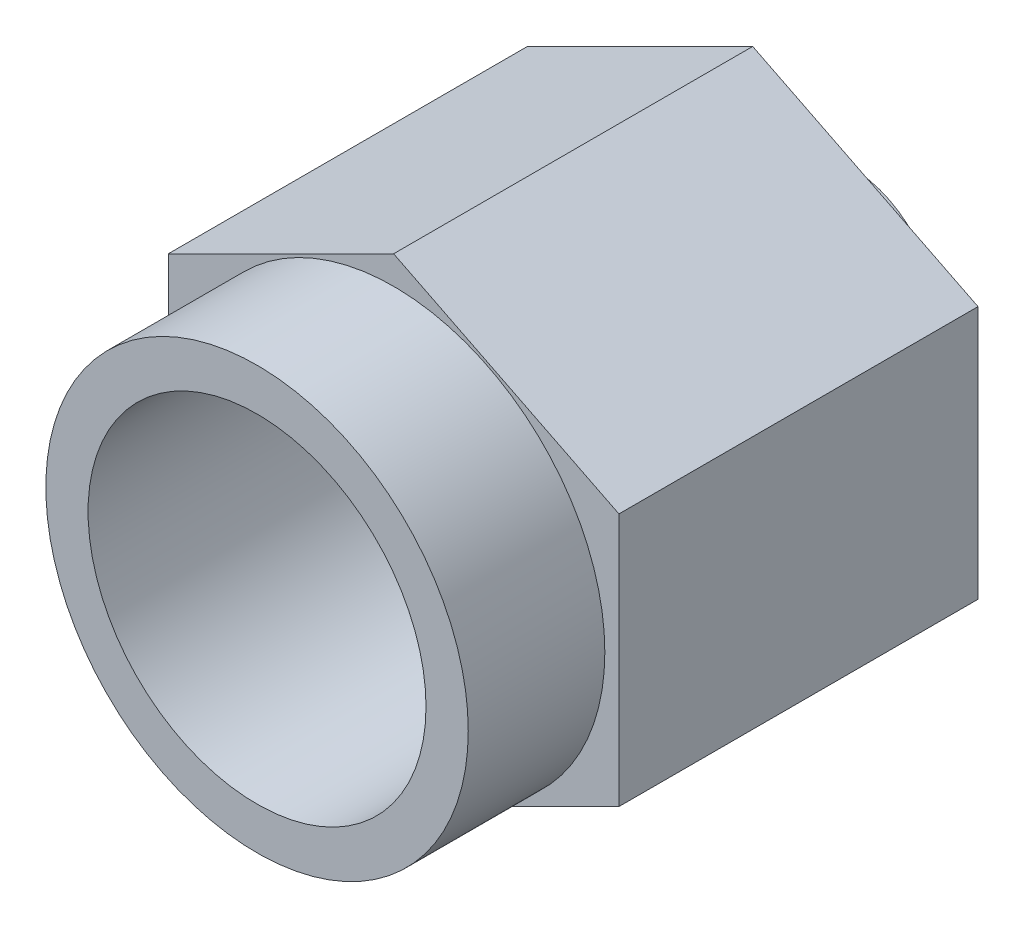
from build123d import *

# Parameters (mm, degrees)
SKETCH2_R                 = 3.81
SKETCH2_R_2               = 3.048
BASE_EXTRUDE_DEPTH        = 8.9408
BOSS_EXTRUDE3_DEPTH       = 6.477
SKETCH4_R                 = 3.048
CUT_EXTRUDE2_DEPTH        = 10
BOSS_EXTRUDE9_DEPTH       = 0.254
BOSS_EXTRUDE9_DEPTH_BACK  = 0.508
SKETCH5_R                 = 3.048
SKETCH5_R_2               = 1.5367
BOSS_EXTRUDE12_DEPTH      = 1.778
BOSS_EXTRUDE12_DEPTH_BACK = 1.778
SKETCH1_R                 = 1.5367
SKETCH1_R_2               = 1.0795


with BuildPart() as part:
    # Sketch2 → Base-Extrude (new body)
    with BuildSketch(Plane.XY):
        Circle(SKETCH2_R)
        Circle(SKETCH2_R_2, mode=Mode.SUBTRACT)
    extrude(amount=BASE_EXTRUDE_DEPTH)

    # Sketch3 → Boss-Extrude3 (add)
    with BuildSketch(Plane.XY):
        Polygon((-4.064, 2.286), (-4.064, -2.286), (0, -4.318), (4.064, -2.286), (4.064, 2.286), (0, 4.318), align=None)
    extrude(amount=BOSS_EXTRUDE3_DEPTH)

    # Sketch4 → Cut-Extrude2 (cut)
    with BuildSketch(Plane.XY):
        Circle(SKETCH4_R)
    extrude(amount=CUT_EXTRUDE2_DEPTH, mode=Mode.SUBTRACT)

    # Sketch5 → Boss-Extrude9 (add, two sides: drawn at the far end of the back side and taken through both)
    with BuildSketch(Plane.XY.offset(-BOSS_EXTRUDE9_DEPTH_BACK)):
        Circle(SKETCH5_R)
        Circle(SKETCH5_R_2, mode=Mode.SUBTRACT)
    extrude(amount=BOSS_EXTRUDE9_DEPTH + BOSS_EXTRUDE9_DEPTH_BACK)

    # Sketch1 → Boss-Extrude12 (add, two sides: drawn at the far end of the back side and taken through both)
    with BuildSketch(Plane.XY.offset(-BOSS_EXTRUDE12_DEPTH_BACK)):
        Circle(SKETCH1_R)
        Circle(SKETCH1_R_2, mode=Mode.SUBTRACT)
    extrude(amount=BOSS_EXTRUDE12_DEPTH + BOSS_EXTRUDE12_DEPTH_BACK)


solid = part.part
